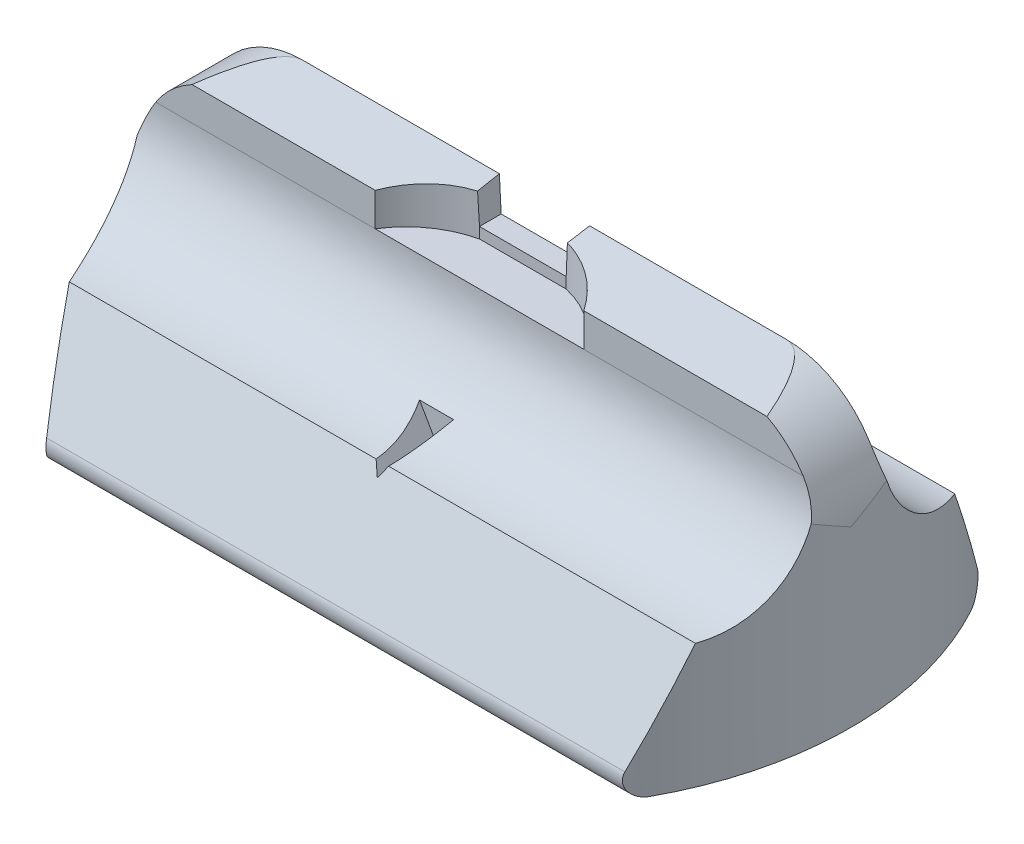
from build123d import *

# Parameters (mm, degrees)
BOSS_EXTRUDE1_DEPTH      = 7.9502
BOSS_EXTRUDE1_DEPTH_BACK = 7.9502
CUT_EXTRUDE1_DEPTH       = 12.090109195
CUT_EXTRUDE2_DEPTH       = 12.090109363
CUT_EXTRUDE2_DEPTH_BACK  = 12.090109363
CUT_EXTRUDE3_DEPTH       = 1.050946
CUT_EXTRUDE4_DEPTH       = 12.193335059
CUT_EXTRUDE4_DEPTH_BACK  = 12.193335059
CUT_EXTRUDE5_DEPTH       = 7.9502
CUT_EXTRUDE5_DEPTH_BACK  = 1.27
FILLET1_R                = 0.4064


with BuildPart() as part:
    # Sketch1 → Boss-Extrude1 (new, two sides: drawn at the far end of the back side and taken through both)
    with BuildSketch(Plane(origin=(0, 0, 0), x_dir=(0, 0, -1), z_dir=(1, 0, 0)).offset(-BOSS_EXTRUDE1_DEPTH_BACK)):
        with BuildLine():
            Line((4.401, 0), (-4.401, 0))
            Line((-4.401, 0), (-3.038915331, 2.921))
            ThreePointArc((-3.038915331, 2.921), (-1.422601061, 3.65758594), (-0.762, 5.30641489))
            Line((-0.762, 5.30641489), (-0.762, 6.088638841))
            Line((-0.762, 6.088638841), (0, 6.223))
            Line((0, 6.223), (0.762, 6.357361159))
            Line((0.762, 6.357361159), (0.762, 5.30641489))
            ThreePointArc((0.762, 5.30641489), (1.422601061, 3.65758594), (3.038915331, 2.921))
            Line((3.038915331, 2.921), (4.401, 0))
        make_face()
    extrude(amount=BOSS_EXTRUDE1_DEPTH + BOSS_EXTRUDE1_DEPTH_BACK)

    # Sketch2 → Cut-Extrude1 (cut, through all)
    with BuildSketch(Plane(origin=(0, 0, 0), x_dir=(1, 0, 0), z_dir=(0, 1, 0))):
        with BuildLine():
            ThreePointArc((6.60544766, 4.401), (7.606511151, 2.300932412), (7.9502, 0))
            Line((7.9502, 0), (7.9502, 4.401))
            Line((7.9502, 4.401), (6.60544766, 4.401))
        make_face()
        with BuildLine():
            Line((6.60544766, -4.401), (7.9502, -4.401))
            Line((7.9502, -4.401), (7.9502, 0))
            ThreePointArc((7.9502, 0), (7.606511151, -2.300932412), (6.60544766, -4.401))
        make_face()
        with BuildLine():
            ThreePointArc((-7.9502, 0), (-7.606511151, 2.300932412), (-6.60544766, 4.401))
            Line((-6.60544766, 4.401), (-7.9502, 4.401))
            Line((-7.9502, 4.401), (-7.9502, 0))
        make_face()
        with BuildLine():
            ThreePointArc((-6.60544766, -4.401), (-7.606511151, -2.300932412), (-7.9502, 0))
            Line((-7.9502, 0), (-7.9502, -4.401))
            Line((-7.9502, -4.401), (-6.60544766, -4.401))
        make_face()
    extrude(amount=CUT_EXTRUDE1_DEPTH, mode=Mode.SUBTRACT)

    # Sketch4 → Cut-Extrude2 (cut, two sides: drawn at the far end of the back side and taken through both)
    with BuildSketch(Plane.XY.offset(-CUT_EXTRUDE2_DEPTH_BACK)):
        with BuildLine():
            Line((-5.6642, 6.357361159), (-7.9502, 6.357361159))
            Line((-7.9502, 6.357361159), (-7.9502, 4.071361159))
            ThreePointArc((-7.9502, 4.071361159), (-7.280646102, 5.687807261), (-5.6642, 6.357361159))
        make_face()
        with BuildLine():
            Line((7.9502, 4.071361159), (7.9502, 6.357361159))
            Line((7.9502, 6.357361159), (5.6642, 6.357361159))
            ThreePointArc((5.6642, 6.357361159), (7.280646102, 5.687807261), (7.9502, 4.071361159))
        make_face()
    extrude(amount=CUT_EXTRUDE2_DEPTH + CUT_EXTRUDE2_DEPTH_BACK, mode=Mode.SUBTRACT)

    # Sketch5 → Cut-Extrude3 (cut)
    with BuildSketch(Plane(origin=(0, 6.357361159, 0), x_dir=(-1, 0, 0), z_dir=(0, 1, 0))):
        with BuildLine():
            Line((-1.016, -0.254), (1.016, -0.254))
            ThreePointArc((1.016, -0.254), (1.832185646, 0.11142249), (2.445733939, 0.762))
            Line((2.445733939, 0.762), (-2.445733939, 0.762))
            ThreePointArc((-2.445733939, 0.762), (-1.832185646, 0.11142249), (-1.016, -0.254))
        make_face()
    extrude(amount=-CUT_EXTRUDE3_DEPTH, mode=Mode.SUBTRACT)

    # Sketch6 → Cut-Extrude4 (cut, two sides: drawn at the far end of the back side and taken through both)
    with BuildSketch(Plane.XY.offset(-0.254).offset(-CUT_EXTRUDE4_DEPTH_BACK)):
        Polygon((1.016, 5.56041489), (-1.016, 5.56041489), (-1.105479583, 7.267787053), (1.105479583, 7.267787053), align=None)
    extrude(amount=CUT_EXTRUDE4_DEPTH + CUT_EXTRUDE4_DEPTH_BACK, mode=Mode.SUBTRACT)

    # Sketch7 → Cut-Extrude5 (cut, two sides: drawn at the far end of the back side and taken through both)
    with BuildSketch(Plane.XY.offset(3.038915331).offset(-CUT_EXTRUDE5_DEPTH_BACK)):
        Polygon((0.39912261, 3.358300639), (-0.39912261, 3.358300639), (0, 2.667), align=None)
    extrude(amount=CUT_EXTRUDE5_DEPTH + CUT_EXTRUDE5_DEPTH_BACK, mode=Mode.SUBTRACT)

    # Fillet1
    fillet1_edges = [part.edges().sort_by_distance(p)[0] for p in [
        (0, 0, -4.401),
        (0, 0, 4.401),
    ]]
    fillet(fillet1_edges, radius=FILLET1_R)


solid = part.part
